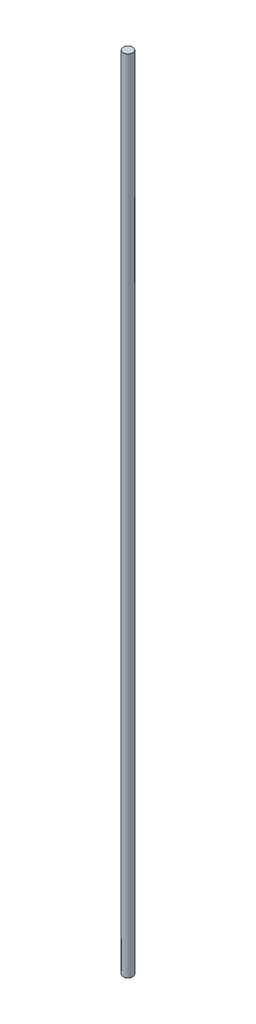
ISO-10303-21;
HEADER;
FILE_DESCRIPTION(('STEP AP214'),'2;1');
FILE_NAME('part.step','',(''),(''),'','','');
FILE_SCHEMA(('AUTOMOTIVE_DESIGN { 1 0 10303 214 1 1 1 1 }'));
ENDSEC;
DATA;
#1=APPLICATION_CONTEXT('core data for automotive mechanical design processes');
#2=APPLICATION_PROTOCOL_DEFINITION('international standard','automotive_design',2000,#1);
#3=PRODUCT_CONTEXT('',#1,'mechanical');
#4=PRODUCT('Part','Part','',(#3));
#5=PRODUCT_RELATED_PRODUCT_CATEGORY('part','',(#4));
#6=PRODUCT_DEFINITION_FORMATION('','',#4);
#7=PRODUCT_DEFINITION_CONTEXT('part definition',#1,'design');
#8=PRODUCT_DEFINITION('design','',#6,#7);
#9=PRODUCT_DEFINITION_SHAPE('','',#8);
#10=(LENGTH_UNIT() NAMED_UNIT(*) SI_UNIT(.MILLI.,.METRE.));
#11=(NAMED_UNIT(*) PLANE_ANGLE_UNIT() SI_UNIT($,.RADIAN.));
#12=(NAMED_UNIT(*) SI_UNIT($,.STERADIAN.) SOLID_ANGLE_UNIT());
#13=UNCERTAINTY_MEASURE_WITH_UNIT(LENGTH_MEASURE(1.E-05),#10,'distance_accuracy_value','');
#14=(GEOMETRIC_REPRESENTATION_CONTEXT(3) GLOBAL_UNCERTAINTY_ASSIGNED_CONTEXT((#13)) GLOBAL_UNIT_ASSIGNED_CONTEXT((#10,
#11,#12)) REPRESENTATION_CONTEXT('',''));
#15=CARTESIAN_POINT('',(0.,0.,0.));
#16=DIRECTION('',(0.,0.,1.));
#17=DIRECTION('',(1.,0.,0.));
#18=AXIS2_PLACEMENT_3D('',#15,#16,#17);
#19=CARTESIAN_POINT('',(0.,1574.8,0.));
#20=DIRECTION('',(0.,-1.,0.));
#21=DIRECTION('',(0.,0.,-1.));
#22=AXIS2_PLACEMENT_3D('',#19,#20,#21);
#23=CYLINDRICAL_SURFACE('',#22,9.525);
#24=CARTESIAN_POINT('',(0.,1574.8,0.));
#25=DIRECTION('',(0.,1.,0.));
#26=DIRECTION('',(0.,0.,1.));
#27=AXIS2_PLACEMENT_3D('',#24,#25,#26);
#28=CIRCLE('',#27,9.525);
#29=CARTESIAN_POINT('',(0.,1574.8,9.525));
#30=VERTEX_POINT('',#29);
#31=EDGE_CURVE('E10',#30,#30,#28,.T.);
#32=ORIENTED_EDGE('',*,*,#31,.F.);
#33=EDGE_LOOP('',(#32));
#34=FACE_BOUND('',#33,.T.);
#35=CARTESIAN_POINT('',(0.,0.,0.));
#36=DIRECTION('',(0.,1.,0.));
#37=DIRECTION('',(0.,0.,1.));
#38=AXIS2_PLACEMENT_3D('',#35,#36,#37);
#39=CIRCLE('',#38,9.525);
#40=CARTESIAN_POINT('',(0.,0.,9.525));
#41=VERTEX_POINT('',#40);
#42=EDGE_CURVE('E34',#41,#41,#39,.T.);
#43=ORIENTED_EDGE('',*,*,#42,.T.);
#44=EDGE_LOOP('',(#43));
#45=FACE_BOUND('',#44,.T.);
#46=ADVANCED_FACE('F31',(#34,#45),#23,.T.);
#47=CARTESIAN_POINT('',(0.,1574.8,0.));
#48=DIRECTION('',(0.,1.,0.));
#49=DIRECTION('',(0.,0.,1.));
#50=AXIS2_PLACEMENT_3D('',#47,#48,#49);
#51=PLANE('',#50);
#52=ORIENTED_EDGE('',*,*,#31,.T.);
#53=EDGE_LOOP('',(#52));
#54=FACE_BOUND('',#53,.T.);
#55=ADVANCED_FACE('F46',(#54),#51,.T.);
#56=CARTESIAN_POINT('',(0.,0.,0.));
#57=DIRECTION('',(0.,1.,0.));
#58=DIRECTION('',(0.,0.,1.));
#59=AXIS2_PLACEMENT_3D('',#56,#57,#58);
#60=PLANE('',#59);
#61=ORIENTED_EDGE('',*,*,#42,.F.);
#62=EDGE_LOOP('',(#61));
#63=FACE_BOUND('',#62,.T.);
#64=ADVANCED_FACE('F44',(#63),#60,.F.);
#65=CLOSED_SHELL('',(#46,#55,#64));
#66=MANIFOLD_SOLID_BREP('B2',#65);
#67=ADVANCED_BREP_SHAPE_REPRESENTATION('',(#18,#66),#14);
#68=SHAPE_DEFINITION_REPRESENTATION(#9,#67);
ENDSEC;
END-ISO-10303-21;
